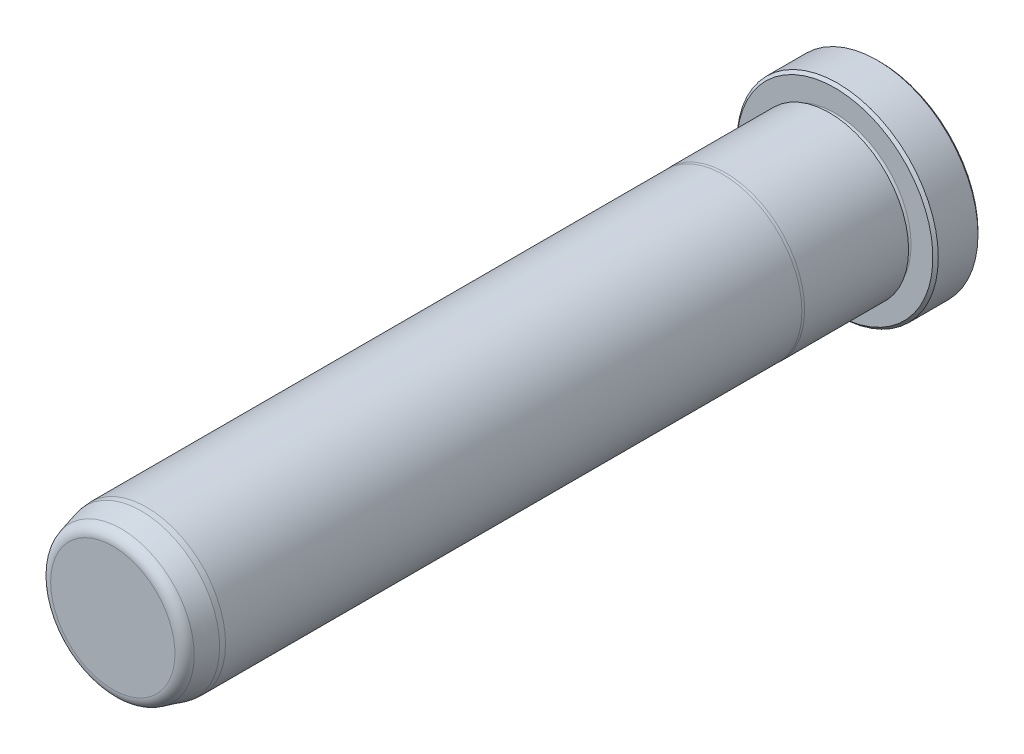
ISO-10303-21;
HEADER;
FILE_DESCRIPTION(('STEP AP214'),'2;1');
FILE_NAME('part.step','',(''),(''),'','','');
FILE_SCHEMA(('AUTOMOTIVE_DESIGN { 1 0 10303 214 1 1 1 1 }'));
ENDSEC;
DATA;
#1=APPLICATION_CONTEXT('core data for automotive mechanical design processes');
#2=APPLICATION_PROTOCOL_DEFINITION('international standard','automotive_design',2000,#1);
#3=PRODUCT_CONTEXT('',#1,'mechanical');
#4=PRODUCT('Part','Part','',(#3));
#5=PRODUCT_RELATED_PRODUCT_CATEGORY('part','',(#4));
#6=PRODUCT_DEFINITION_FORMATION('','',#4);
#7=PRODUCT_DEFINITION_CONTEXT('part definition',#1,'design');
#8=PRODUCT_DEFINITION('design','',#6,#7);
#9=PRODUCT_DEFINITION_SHAPE('','',#8);
#10=(LENGTH_UNIT() NAMED_UNIT(*) SI_UNIT(.MILLI.,.METRE.));
#11=(NAMED_UNIT(*) PLANE_ANGLE_UNIT() SI_UNIT($,.RADIAN.));
#12=(NAMED_UNIT(*) SI_UNIT($,.STERADIAN.) SOLID_ANGLE_UNIT());
#13=UNCERTAINTY_MEASURE_WITH_UNIT(LENGTH_MEASURE(1.E-05),#10,'distance_accuracy_value','');
#14=(GEOMETRIC_REPRESENTATION_CONTEXT(3) GLOBAL_UNCERTAINTY_ASSIGNED_CONTEXT((#13)) GLOBAL_UNIT_ASSIGNED_CONTEXT((#10,
#11,#12)) REPRESENTATION_CONTEXT('',''));
#15=CARTESIAN_POINT('',(0.,0.,0.));
#16=DIRECTION('',(0.,0.,1.));
#17=DIRECTION('',(1.,0.,0.));
#18=AXIS2_PLACEMENT_3D('',#15,#16,#17);
#19=CARTESIAN_POINT('',(0.,0.,0.));
#20=DIRECTION('',(0.,0.,1.));
#21=DIRECTION('',(1.,0.,0.));
#22=AXIS2_PLACEMENT_3D('',#19,#20,#21);
#23=PLANE('',#22);
#24=CARTESIAN_POINT('',(0.,0.,0.));
#25=DIRECTION('',(0.,0.,1.));
#26=DIRECTION('',(1.,0.,0.));
#27=AXIS2_PLACEMENT_3D('',#24,#25,#26);
#28=CIRCLE('',#27,13.7795);
#29=CARTESIAN_POINT('',(13.7795,0.,0.));
#30=VERTEX_POINT('',#29);
#31=EDGE_CURVE('E37',#30,#30,#28,.F.);
#32=ORIENTED_EDGE('',*,*,#31,.T.);
#33=EDGE_LOOP('',(#32));
#34=FACE_BOUND('',#33,.T.);
#35=ADVANCED_FACE('F30',(#34),#23,.F.);
#36=CARTESIAN_POINT('',(0.,0.,0.));
#37=DIRECTION('',(0.,0.,1.));
#38=DIRECTION('',(1.,0.,0.));
#39=AXIS2_PLACEMENT_3D('',#36,#37,#38);
#40=CYLINDRICAL_SURFACE('',#39,14.1605);
#41=CARTESIAN_POINT('',(0.,0.,0.381000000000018));
#42=DIRECTION('',(0.,0.,1.));
#43=DIRECTION('',(1.,0.,0.));
#44=AXIS2_PLACEMENT_3D('',#41,#42,#43);
#45=CIRCLE('',#44,14.1605);
#46=CARTESIAN_POINT('',(14.1605,0.,0.381000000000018));
#47=VERTEX_POINT('',#46);
#48=EDGE_CURVE('E41',#47,#47,#45,.T.);
#49=ORIENTED_EDGE('',*,*,#48,.T.);
#50=EDGE_LOOP('',(#49));
#51=FACE_BOUND('',#50,.T.);
#52=CARTESIAN_POINT('',(0.,0.,5.96899999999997));
#53=DIRECTION('',(0.,0.,-1.));
#54=DIRECTION('',(-1.,0.,0.));
#55=AXIS2_PLACEMENT_3D('',#52,#53,#54);
#56=CIRCLE('',#55,14.1605);
#57=CARTESIAN_POINT('',(-14.1605,0.,5.96899999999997));
#58=VERTEX_POINT('',#57);
#59=EDGE_CURVE('E45',#58,#58,#56,.T.);
#60=ORIENTED_EDGE('',*,*,#59,.T.);
#61=EDGE_LOOP('',(#60));
#62=FACE_BOUND('',#61,.T.);
#63=ADVANCED_FACE('F118',(#51,#62),#40,.T.);
#64=CARTESIAN_POINT('',(0.,14.1605,6.35));
#65=DIRECTION('',(0.,0.,-1.));
#66=DIRECTION('',(-1.,0.,0.));
#67=AXIS2_PLACEMENT_3D('',#64,#65,#66);
#68=PLANE('',#67);
#69=CARTESIAN_POINT('',(0.,0.,6.35));
#70=DIRECTION('',(0.,0.,-1.));
#71=DIRECTION('',(-1.,0.,0.));
#72=AXIS2_PLACEMENT_3D('',#69,#70,#71);
#73=CIRCLE('',#72,13.7795);
#74=CARTESIAN_POINT('',(-13.7795,0.,6.35));
#75=VERTEX_POINT('',#74);
#76=EDGE_CURVE('E10',#75,#75,#73,.F.);
#77=ORIENTED_EDGE('',*,*,#76,.T.);
#78=EDGE_LOOP('',(#77));
#79=FACE_BOUND('',#78,.T.);
#80=CARTESIAN_POINT('',(0.,0.,6.35));
#81=DIRECTION('',(0.,0.,1.));
#82=DIRECTION('',(1.,0.,0.));
#83=AXIS2_PLACEMENT_3D('',#80,#81,#82);
#84=CIRCLE('',#83,10.7188);
#85=CARTESIAN_POINT('',(10.7188,0.,6.35));
#86=VERTEX_POINT('',#85);
#87=EDGE_CURVE('E56',#86,#86,#84,.T.);
#88=ORIENTED_EDGE('',*,*,#87,.F.);
#89=EDGE_LOOP('',(#88));
#90=FACE_BOUND('',#89,.T.);
#91=ADVANCED_FACE('F113',(#79,#90),#68,.F.);
#92=CARTESIAN_POINT('',(0.,0.,6.731));
#93=DIRECTION('',(0.,0.,1.));
#94=DIRECTION('',(1.,0.,0.));
#95=AXIS2_PLACEMENT_3D('',#92,#93,#94);
#96=TOROIDAL_SURFACE('',#95,10.7188,0.381000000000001);
#97=CARTESIAN_POINT('',(0.,0.,7.112));
#98=DIRECTION('',(0.,0.,1.));
#99=DIRECTION('',(1.,0.,0.));
#100=AXIS2_PLACEMENT_3D('',#97,#98,#99);
#101=CIRCLE('',#100,10.7188);
#102=CARTESIAN_POINT('',(10.7188,0.,7.112));
#103=VERTEX_POINT('',#102);
#104=EDGE_CURVE('E59',#103,#103,#101,.T.);
#105=ORIENTED_EDGE('',*,*,#104,.F.);
#106=EDGE_LOOP('',(#105));
#107=FACE_BOUND('',#106,.T.);
#108=ORIENTED_EDGE('',*,*,#87,.T.);
#109=EDGE_LOOP('',(#108));
#110=FACE_BOUND('',#109,.T.);
#111=ADVANCED_FACE('F107',(#107,#110),#96,.F.);
#112=CARTESIAN_POINT('',(0.,10.7188,7.112));
#113=DIRECTION('',(0.,0.,1.));
#114=DIRECTION('',(1.,0.,0.));
#115=AXIS2_PLACEMENT_3D('',#112,#113,#114);
#116=PLANE('',#115);
#117=CARTESIAN_POINT('',(0.,0.,7.112));
#118=DIRECTION('',(0.,0.,1.));
#119=DIRECTION('',(1.,0.,0.));
#120=AXIS2_PLACEMENT_3D('',#117,#118,#119);
#121=CIRCLE('',#120,11.1252);
#122=CARTESIAN_POINT('',(11.1252,0.,7.112));
#123=VERTEX_POINT('',#122);
#124=EDGE_CURVE('E62',#123,#123,#121,.T.);
#125=ORIENTED_EDGE('',*,*,#124,.F.);
#126=EDGE_LOOP('',(#125));
#127=FACE_BOUND('',#126,.T.);
#128=ORIENTED_EDGE('',*,*,#104,.T.);
#129=EDGE_LOOP('',(#128));
#130=FACE_BOUND('',#129,.T.);
#131=ADVANCED_FACE('F101',(#127,#130),#116,.F.);
#132=CARTESIAN_POINT('',(0.,0.,0.));
#133=DIRECTION('',(0.,0.,1.));
#134=DIRECTION('',(1.,0.,0.));
#135=AXIS2_PLACEMENT_3D('',#132,#133,#134);
#136=CYLINDRICAL_SURFACE('',#135,11.1252);
#137=CARTESIAN_POINT('',(0.,0.,21.7347630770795));
#138=DIRECTION('',(0.,0.,1.));
#139=DIRECTION('',(1.,0.,0.));
#140=AXIS2_PLACEMENT_3D('',#137,#138,#139);
#141=CIRCLE('',#140,11.1252);
#142=CARTESIAN_POINT('',(11.1252,0.,21.7347630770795));
#143=VERTEX_POINT('',#142);
#144=EDGE_CURVE('E65',#143,#143,#141,.T.);
#145=ORIENTED_EDGE('',*,*,#144,.F.);
#146=EDGE_LOOP('',(#145));
#147=FACE_BOUND('',#146,.T.);
#148=ORIENTED_EDGE('',*,*,#124,.T.);
#149=EDGE_LOOP('',(#148));
#150=FACE_BOUND('',#149,.T.);
#151=ADVANCED_FACE('F95',(#147,#150),#136,.T.);
#152=CARTESIAN_POINT('',(0.,0.,21.7347630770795));
#153=DIRECTION('',(0.,0.,-1.));
#154=DIRECTION('',(-1.,0.,0.));
#155=AXIS2_PLACEMENT_3D('',#152,#153,#154);
#156=CONICAL_SURFACE('',#155,11.1252,0.0698131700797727);
#157=CARTESIAN_POINT('',(0.,0.,22.098));
#158=DIRECTION('',(0.,0.,1.));
#159=DIRECTION('',(1.,0.,0.));
#160=AXIS2_PLACEMENT_3D('',#157,#158,#159);
#161=CIRCLE('',#160,11.0998);
#162=CARTESIAN_POINT('',(11.0998,0.,22.098));
#163=VERTEX_POINT('',#162);
#164=EDGE_CURVE('E68',#163,#163,#161,.T.);
#165=ORIENTED_EDGE('',*,*,#164,.F.);
#166=EDGE_LOOP('',(#165));
#167=FACE_BOUND('',#166,.T.);
#168=ORIENTED_EDGE('',*,*,#144,.T.);
#169=EDGE_LOOP('',(#168));
#170=FACE_BOUND('',#169,.T.);
#171=ADVANCED_FACE('F89',(#167,#170),#156,.T.);
#172=CARTESIAN_POINT('',(0.,0.,0.));
#173=DIRECTION('',(0.,0.,1.));
#174=DIRECTION('',(1.,0.,0.));
#175=AXIS2_PLACEMENT_3D('',#172,#173,#174);
#176=CYLINDRICAL_SURFACE('',#175,11.0998);
#177=CARTESIAN_POINT('',(0.,0.,103.1875));
#178=DIRECTION('',(0.,0.,1.));
#179=DIRECTION('',(1.,0.,0.));
#180=AXIS2_PLACEMENT_3D('',#177,#178,#179);
#181=CIRCLE('',#180,11.0998);
#182=CARTESIAN_POINT('',(11.0998,0.,103.1875));
#183=VERTEX_POINT('',#182);
#184=EDGE_CURVE('E71',#183,#183,#181,.T.);
#185=ORIENTED_EDGE('',*,*,#184,.F.);
#186=EDGE_LOOP('',(#185));
#187=FACE_BOUND('',#186,.T.);
#188=ORIENTED_EDGE('',*,*,#164,.T.);
#189=EDGE_LOOP('',(#188));
#190=FACE_BOUND('',#189,.T.);
#191=ADVANCED_FACE('F83',(#187,#190),#176,.T.);
#192=CARTESIAN_POINT('',(0.,0.,103.1875));
#193=DIRECTION('',(0.,0.,-1.));
#194=DIRECTION('',(-1.,0.,0.));
#195=AXIS2_PLACEMENT_3D('',#192,#193,#194);
#196=CONICAL_SURFACE('',#195,11.0998,0.0872664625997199);
#197=CARTESIAN_POINT('',(0.,0.,103.9495));
#198=DIRECTION('',(0.,0.,1.));
#199=DIRECTION('',(1.,0.,0.));
#200=AXIS2_PLACEMENT_3D('',#197,#198,#199);
#201=CIRCLE('',#200,11.0331336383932);
#202=CARTESIAN_POINT('',(11.0331336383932,0.,103.9495));
#203=VERTEX_POINT('',#202);
#204=EDGE_CURVE('E74',#203,#203,#201,.T.);
#205=ORIENTED_EDGE('',*,*,#204,.F.);
#206=EDGE_LOOP('',(#205));
#207=FACE_BOUND('',#206,.T.);
#208=ORIENTED_EDGE('',*,*,#184,.T.);
#209=EDGE_LOOP('',(#208));
#210=FACE_BOUND('',#209,.T.);
#211=ADVANCED_FACE('F80',(#207,#210),#196,.T.);
#212=CARTESIAN_POINT('',(0.,0.,103.9495));
#213=DIRECTION('',(0.,0.,-1.));
#214=DIRECTION('',(-1.,0.,0.));
#215=AXIS2_PLACEMENT_3D('',#212,#213,#214);
#216=CONICAL_SURFACE('',#215,11.0331336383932,0.261799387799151);
#217=CARTESIAN_POINT('',(0.,0.,106.7733752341));
#218=DIRECTION('',(0.,0.,1.));
#219=DIRECTION('',(1.,0.,0.));
#220=AXIS2_PLACEMENT_3D('',#217,#218,#219);
#221=CIRCLE('',#220,10.2764785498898);
#222=CARTESIAN_POINT('',(10.2764785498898,0.,106.7733752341));
#223=VERTEX_POINT('',#222);
#224=EDGE_CURVE('E50',#223,#223,#221,.F.);
#225=ORIENTED_EDGE('',*,*,#224,.T.);
#226=EDGE_LOOP('',(#225));
#227=FACE_BOUND('',#226,.T.);
#228=ORIENTED_EDGE('',*,*,#204,.T.);
#229=EDGE_LOOP('',(#228));
#230=FACE_BOUND('',#229,.T.);
#231=ADVANCED_FACE('F78',(#227,#230),#216,.T.);
#232=CARTESIAN_POINT('',(0.,9.96120289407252,107.95));
#233=DIRECTION('',(0.,0.,-1.));
#234=DIRECTION('',(-1.,0.,0.));
#235=AXIS2_PLACEMENT_3D('',#232,#233,#234);
#236=PLANE('',#235);
#237=CARTESIAN_POINT('',(0.,0.,107.95));
#238=DIRECTION('',(0.,0.,-1.));
#239=DIRECTION('',(-1.,0.,0.));
#240=AXIS2_PLACEMENT_3D('',#237,#238,#239);
#241=CIRCLE('',#240,8.74307130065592);
#242=CARTESIAN_POINT('',(-8.74307130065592,0.,107.95));
#243=VERTEX_POINT('',#242);
#244=EDGE_CURVE('E53',#243,#243,#241,.F.);
#245=ORIENTED_EDGE('',*,*,#244,.T.);
#246=EDGE_LOOP('',(#245));
#247=FACE_BOUND('',#246,.T.);
#248=ADVANCED_FACE('F133',(#247),#236,.F.);
#249=CARTESIAN_POINT('',(0.,0.,106.3625));
#250=DIRECTION('',(0.,0.,-1.));
#251=DIRECTION('',(-1.,0.,0.));
#252=AXIS2_PLACEMENT_3D('',#249,#250,#251);
#253=TOROIDAL_SURFACE('',#252,8.74307130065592,1.5875);
#254=ORIENTED_EDGE('',*,*,#224,.F.);
#255=EDGE_LOOP('',(#254));
#256=FACE_BOUND('',#255,.T.);
#257=ORIENTED_EDGE('',*,*,#244,.F.);
#258=EDGE_LOOP('',(#257));
#259=FACE_BOUND('',#258,.T.);
#260=ADVANCED_FACE('F130',(#256,#259),#253,.T.);
#261=CARTESIAN_POINT('',(0.,0.,0.381000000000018));
#262=DIRECTION('',(0.,0.,1.));
#263=DIRECTION('',(1.,0.,0.));
#264=AXIS2_PLACEMENT_3D('',#261,#262,#263);
#265=CONICAL_SURFACE('',#264,14.1605,0.785398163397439);
#266=CARTESIAN_POINT('',(13.7795,0.,0.));
#267=CARTESIAN_POINT('',(13.78346875,0.,0.00396875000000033));
#268=CARTESIAN_POINT('',(13.7874375,0.,0.00793750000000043));
#269=CARTESIAN_POINT('',(13.795375,0.,0.0158750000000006));
#270=CARTESIAN_POINT('',(13.79934375,0.,0.0198437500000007));
#271=CARTESIAN_POINT('',(13.80728125,0.,0.0277812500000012));
#272=CARTESIAN_POINT('',(13.81125,0.,0.0317500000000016));
#273=CARTESIAN_POINT('',(13.8191875,0.,0.039687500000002));
#274=CARTESIAN_POINT('',(13.82315625,0.,0.0436562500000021));
#275=CARTESIAN_POINT('',(13.83109375,0.,0.0515937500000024));
#276=CARTESIAN_POINT('',(13.8350625,0.,0.0555625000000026));
#277=CARTESIAN_POINT('',(13.843,0.,0.063500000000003));
#278=CARTESIAN_POINT('',(13.84696875,0.,0.0674687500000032));
#279=CARTESIAN_POINT('',(13.85490625,0.,0.0754062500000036));
#280=CARTESIAN_POINT('',(13.858875,0.,0.0793750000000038));
#281=CARTESIAN_POINT('',(13.8668125,0.,0.0873125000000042));
#282=CARTESIAN_POINT('',(13.87078125,0.,0.0912812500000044));
#283=CARTESIAN_POINT('',(13.87871875,0.,0.0992187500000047));
#284=CARTESIAN_POINT('',(13.8826875,0.,0.103187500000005));
#285=CARTESIAN_POINT('',(13.890625,0.,0.111125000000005));
#286=CARTESIAN_POINT('',(13.89459375,0.,0.115093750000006));
#287=CARTESIAN_POINT('',(13.90253125,0.,0.123031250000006));
#288=CARTESIAN_POINT('',(13.9065,0.,0.127000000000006));
#289=CARTESIAN_POINT('',(13.9144375,0.,0.134937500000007));
#290=CARTESIAN_POINT('',(13.91840625,0.,0.138906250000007));
#291=CARTESIAN_POINT('',(13.92634375,0.,0.146843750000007));
#292=CARTESIAN_POINT('',(13.9303125,0.,0.150812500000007));
#293=CARTESIAN_POINT('',(13.93825,0.,0.158750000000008));
#294=CARTESIAN_POINT('',(13.94221875,0.,0.162718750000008));
#295=CARTESIAN_POINT('',(13.95015625,0.,0.170656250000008));
#296=CARTESIAN_POINT('',(13.954125,0.,0.174625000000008));
#297=CARTESIAN_POINT('',(13.9620625,0.,0.182562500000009));
#298=CARTESIAN_POINT('',(13.96603125,0.,0.186531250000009));
#299=CARTESIAN_POINT('',(13.97396875,0.,0.19446875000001));
#300=CARTESIAN_POINT('',(13.9779375,0.,0.19843750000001));
#301=CARTESIAN_POINT('',(13.985875,0.,0.20637500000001));
#302=CARTESIAN_POINT('',(13.98984375,0.,0.21034375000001));
#303=CARTESIAN_POINT('',(13.99778125,0.,0.218281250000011));
#304=CARTESIAN_POINT('',(14.00175,0.,0.222250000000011));
#305=CARTESIAN_POINT('',(14.0096875,0.,0.230187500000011));
#306=CARTESIAN_POINT('',(14.01365625,0.,0.234156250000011));
#307=CARTESIAN_POINT('',(14.02159375,0.,0.242093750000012));
#308=CARTESIAN_POINT('',(14.0255625,0.,0.246062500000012));
#309=CARTESIAN_POINT('',(14.0335,0.,0.254000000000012));
#310=CARTESIAN_POINT('',(14.03746875,0.,0.257968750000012));
#311=CARTESIAN_POINT('',(14.04540625,0.,0.265906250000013));
#312=CARTESIAN_POINT('',(14.049375,0.,0.269875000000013));
#313=CARTESIAN_POINT('',(14.0573125,0.,0.277812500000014));
#314=CARTESIAN_POINT('',(14.06128125,0.,0.281781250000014));
#315=CARTESIAN_POINT('',(14.06921875,0.,0.289718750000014));
#316=CARTESIAN_POINT('',(14.0731875,0.,0.293687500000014));
#317=CARTESIAN_POINT('',(14.081125,0.,0.301625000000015));
#318=CARTESIAN_POINT('',(14.08509375,0.,0.305593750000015));
#319=CARTESIAN_POINT('',(14.09303125,0.,0.313531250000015));
#320=CARTESIAN_POINT('',(14.097,0.,0.317500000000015));
#321=CARTESIAN_POINT('',(14.1049375,0.,0.325437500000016));
#322=CARTESIAN_POINT('',(14.10890625,0.,0.329406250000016));
#323=CARTESIAN_POINT('',(14.11684375,0.,0.337343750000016));
#324=CARTESIAN_POINT('',(14.1208125,0.,0.341312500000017));
#325=CARTESIAN_POINT('',(14.12875,0.,0.349250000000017));
#326=CARTESIAN_POINT('',(14.13271875,0.,0.353218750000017));
#327=CARTESIAN_POINT('',(14.14065625,0.,0.361156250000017));
#328=CARTESIAN_POINT('',(14.144625,0.,0.365125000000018));
#329=CARTESIAN_POINT('',(14.1525625,0.,0.373062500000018));
#330=CARTESIAN_POINT('',(14.15653125,0.,0.377031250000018));
#331=CARTESIAN_POINT('',(14.1605,0.,0.381000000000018));
#332=B_SPLINE_CURVE_WITH_KNOTS('',3,(#266,#267,#268,#269,#270,#271,#272,#273,#274,#275,#276,
#277,#278,#279,#280,#281,#282,#283,#284,#285,#286,#287,#288,#289,#290,#291,#292,#293,#294,#295,
#296,#297,#298,#299,#300,#301,#302,#303,#304,#305,#306,#307,#308,#309,#310,#311,#312,#313,#314,
#315,#316,#317,#318,#319,#320,#321,#322,#323,#324,#325,#326,#327,#328,#329,#330,#331),
.UNSPECIFIED.,.F.,.F.,(4,2,2,2,2,2,2,2,2,2,2,2,2,2,2,2,2,2,2,2,2,2,2,2,2,2,2,2,2,2,2,2,4),(0.,
0.0168379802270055,0.033675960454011,0.0505139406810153,0.0673519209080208,0.0841899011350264,
0.101027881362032,0.117865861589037,0.134703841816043,0.151541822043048,0.168379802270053,
0.185217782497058,0.202055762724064,0.218893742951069,0.235731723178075,0.25256970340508,
0.269407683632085,0.28624566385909,0.303083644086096,0.319921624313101,0.336759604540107,
0.353597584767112,0.370435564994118,0.387273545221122,0.404111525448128,0.420949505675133,
0.437787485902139,0.454625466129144,0.47146344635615,0.488301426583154,0.505139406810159,
0.521977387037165,0.53881536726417),.UNSPECIFIED.);
#333=EDGE_CURVE('BSEAM132',#30,#47,#332,.T.);
#334=ORIENTED_EDGE('',*,*,#31,.F.);
#335=ORIENTED_EDGE('',*,*,#48,.F.);
#336=ORIENTED_EDGE('',*,*,#333,.T.);
#337=ORIENTED_EDGE('',*,*,#333,.F.);
#338=EDGE_LOOP('',(#334,#336,#335,#337));
#339=FACE_BOUND('',#338,.T.);
#340=ADVANCED_FACE('F132',(#339),#265,.T.);
#341=CARTESIAN_POINT('',(0.,0.,6.35));
#342=DIRECTION('',(0.,0.,-1.));
#343=DIRECTION('',(-1.,0.,0.));
#344=AXIS2_PLACEMENT_3D('',#341,#342,#343);
#345=CONICAL_SURFACE('',#344,13.7795,0.785398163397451);
#346=ORIENTED_EDGE('',*,*,#59,.F.);
#347=EDGE_LOOP('',(#346));
#348=FACE_BOUND('',#347,.T.);
#349=ORIENTED_EDGE('',*,*,#76,.F.);
#350=EDGE_LOOP('',(#349));
#351=FACE_BOUND('',#350,.T.);
#352=ADVANCED_FACE('F32',(#348,#351),#345,.T.);
#353=CLOSED_SHELL('',(#35,#63,#91,#111,#131,#151,#171,#191,#211,#231,#248,#260,#340,#352));
#354=MANIFOLD_SOLID_BREP('B2',#353);
#355=ADVANCED_BREP_SHAPE_REPRESENTATION('',(#18,#354),#14);
#356=SHAPE_DEFINITION_REPRESENTATION(#9,#355);
ENDSEC;
END-ISO-10303-21;
